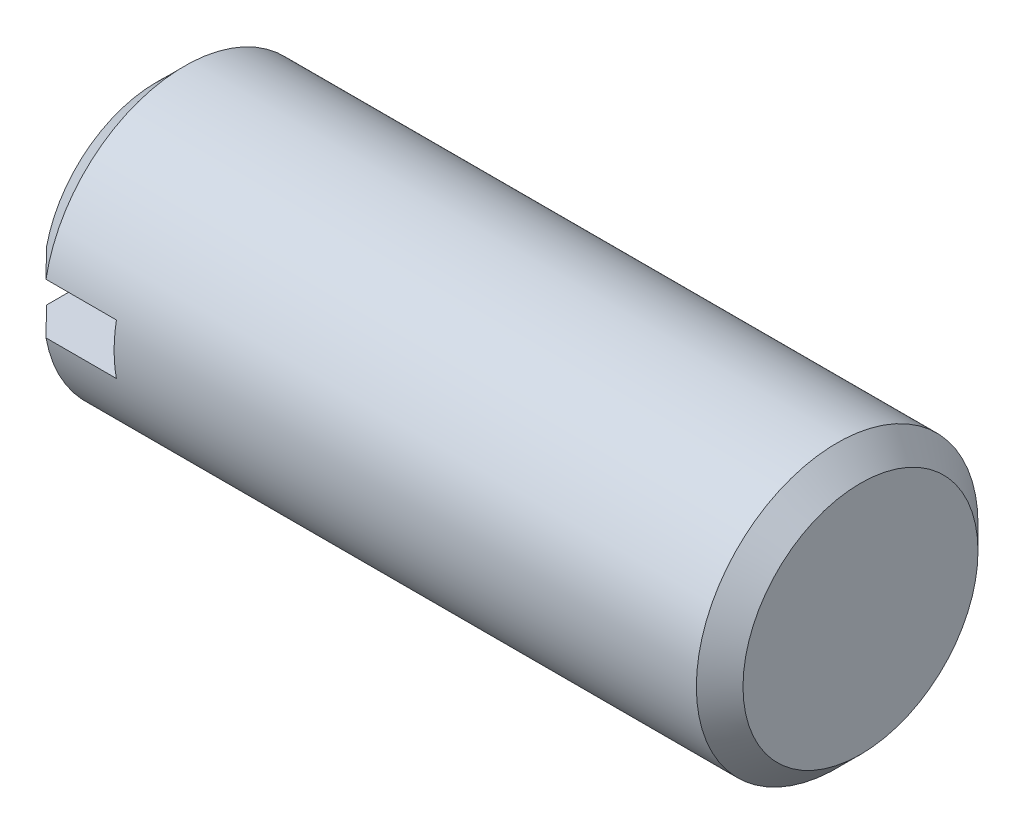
ISO-10303-21;
HEADER;
FILE_DESCRIPTION(('STEP AP214'),'2;1');
FILE_NAME('part.step','',(''),(''),'','','');
FILE_SCHEMA(('AUTOMOTIVE_DESIGN { 1 0 10303 214 1 1 1 1 }'));
ENDSEC;
DATA;
#1=APPLICATION_CONTEXT('core data for automotive mechanical design processes');
#2=APPLICATION_PROTOCOL_DEFINITION('international standard','automotive_design',2000,#1);
#3=PRODUCT_CONTEXT('',#1,'mechanical');
#4=PRODUCT('Part','Part','',(#3));
#5=PRODUCT_RELATED_PRODUCT_CATEGORY('part','',(#4));
#6=PRODUCT_DEFINITION_FORMATION('','',#4);
#7=PRODUCT_DEFINITION_CONTEXT('part definition',#1,'design');
#8=PRODUCT_DEFINITION('design','',#6,#7);
#9=PRODUCT_DEFINITION_SHAPE('','',#8);
#10=(LENGTH_UNIT() NAMED_UNIT(*) SI_UNIT(.MILLI.,.METRE.));
#11=(NAMED_UNIT(*) PLANE_ANGLE_UNIT() SI_UNIT($,.RADIAN.));
#12=(NAMED_UNIT(*) SI_UNIT($,.STERADIAN.) SOLID_ANGLE_UNIT());
#13=UNCERTAINTY_MEASURE_WITH_UNIT(LENGTH_MEASURE(1.E-05),#10,'distance_accuracy_value','');
#14=(GEOMETRIC_REPRESENTATION_CONTEXT(3) GLOBAL_UNCERTAINTY_ASSIGNED_CONTEXT((#13)) GLOBAL_UNIT_ASSIGNED_CONTEXT((#10,
#11,#12)) REPRESENTATION_CONTEXT('',''));
#15=CARTESIAN_POINT('',(0.,0.,0.));
#16=DIRECTION('',(0.,0.,1.));
#17=DIRECTION('',(1.,0.,0.));
#18=AXIS2_PLACEMENT_3D('',#15,#16,#17);
#19=CARTESIAN_POINT('',(0.,0.,0.));
#20=DIRECTION('',(-1.,0.,0.));
#21=DIRECTION('',(0.,0.,1.));
#22=AXIS2_PLACEMENT_3D('',#19,#20,#21);
#23=PLANE('',#22);
#24=DIRECTION('',(0.,0.,1.));
#25=VECTOR('',#24,1.);
#26=CARTESIAN_POINT('',(0.,0.9,-5.));
#27=LINE('',#26,#25);
#28=CARTESIAN_POINT('',(0.,0.9,-3.89743505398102));
#29=VERTEX_POINT('',#28);
#30=CARTESIAN_POINT('',(0.,0.9,3.89743505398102));
#31=VERTEX_POINT('',#30);
#32=EDGE_CURVE('E114',#29,#31,#27,.T.);
#33=ORIENTED_EDGE('',*,*,#32,.T.);
#34=CARTESIAN_POINT('',(0.,0.,0.));
#35=DIRECTION('',(-1.,0.,0.));
#36=DIRECTION('',(0.,0.,1.));
#37=AXIS2_PLACEMENT_3D('',#34,#35,#36);
#38=CIRCLE('',#37,4.);
#39=EDGE_CURVE('E102',#31,#29,#38,.T.);
#40=ORIENTED_EDGE('',*,*,#39,.T.);
#41=EDGE_LOOP('',(#33,#40));
#42=FACE_BOUND('',#41,.T.);
#43=ADVANCED_FACE('F39',(#42),#23,.T.);
#44=CARTESIAN_POINT('',(0.,0.,0.));
#45=DIRECTION('',(1.,0.,0.));
#46=DIRECTION('',(0.,0.,-1.));
#47=AXIS2_PLACEMENT_3D('',#44,#45,#46);
#48=CONICAL_SURFACE('',#47,4.,0.785398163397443);
#49=CARTESIAN_POINT('',(7.03012537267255,0.9,10.9933464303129));
#50=CARTESIAN_POINT('',(6.63966757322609,0.9,10.6015706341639));
#51=CARTESIAN_POINT('',(6.24926843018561,0.9,10.2097363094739));
#52=CARTESIAN_POINT('',(5.46864929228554,0.9,9.4258507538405));
#53=CARTESIAN_POINT('',(5.07842930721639,0.9,9.03379951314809));
#54=CARTESIAN_POINT('',(4.29780491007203,0.9,8.2489524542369));
#55=CARTESIAN_POINT('',(3.90740083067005,0.9,7.85615630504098));
#56=CARTESIAN_POINT('',(3.12704713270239,0.9,7.07015018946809));
#57=CARTESIAN_POINT('',(2.73709749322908,0.9,6.67694024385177));
#58=CARTESIAN_POINT('',(1.9790862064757,0.9,5.91120220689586));
#59=CARTESIAN_POINT('',(1.61098679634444,0.9,5.5387115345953));
#60=CARTESIAN_POINT('',(1.05967971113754,0.9,4.9790923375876));
#61=CARTESIAN_POINT('',(0.876037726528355,0.9,4.79239182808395));
#62=CARTESIAN_POINT('',(0.509170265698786,0.9,4.41858689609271));
#63=CARTESIAN_POINT('',(0.325944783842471,0.9,4.23148247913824));
#64=CARTESIAN_POINT('',(-0.0397740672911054,0.9,3.85681926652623));
#65=CARTESIAN_POINT('',(-0.222267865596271,0.9,3.66926089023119));
#66=CARTESIAN_POINT('',(-0.586330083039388,0.9,3.29322885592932));
#67=CARTESIAN_POINT('',(-0.767898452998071,0.9,3.10475515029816));
#68=CARTESIAN_POINT('',(-1.12946116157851,0.9,2.72638707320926));
#69=CARTESIAN_POINT('',(-1.30945588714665,0.9,2.5364930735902));
#70=CARTESIAN_POINT('',(-1.57726099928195,0.9,2.24962317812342));
#71=CARTESIAN_POINT('',(-1.66616118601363,0.9,2.1536658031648));
#72=CARTESIAN_POINT('',(-1.84289220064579,0.9,1.96077237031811));
#73=CARTESIAN_POINT('',(-1.93072306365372,0.9,1.86383634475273));
#74=CARTESIAN_POINT('',(-2.04199789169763,0.9,1.73894271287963));
#75=CARTESIAN_POINT('',(-2.06619519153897,0.9,1.71165610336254));
#76=CARTESIAN_POINT('',(-2.11444279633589,0.9,1.65695283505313));
#77=CARTESIAN_POINT('',(-2.13849309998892,0.9,1.62953617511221));
#78=CARTESIAN_POINT('',(-2.21039843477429,0.9,1.54706208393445));
#79=CARTESIAN_POINT('',(-2.2580032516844,0.9,1.49178573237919));
#80=CARTESIAN_POINT('',(-2.35275663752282,0.9,1.37996436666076));
#81=CARTESIAN_POINT('',(-2.39989697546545,0.9,1.32341235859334));
#82=CARTESIAN_POINT('',(-2.49291381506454,0.9,1.20929859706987));
#83=CARTESIAN_POINT('',(-2.5387906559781,0.9,1.15173712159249));
#84=CARTESIAN_POINT('',(-2.62920268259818,0.9,1.03464389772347));
#85=CARTESIAN_POINT('',(-2.6737199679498,0.9,0.975098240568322));
#86=CARTESIAN_POINT('',(-2.76007627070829,0.9,0.85394570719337));
#87=CARTESIAN_POINT('',(-2.80191166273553,0.9,0.792336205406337));
#88=CARTESIAN_POINT('',(-2.88088250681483,0.9,0.666924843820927));
#89=CARTESIAN_POINT('',(-2.91805737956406,0.9,0.603148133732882));
#90=CARTESIAN_POINT('',(-2.98530096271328,0.9,0.471982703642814));
#91=CARTESIAN_POINT('',(-3.01539165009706,0.9,0.404605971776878));
#92=CARTESIAN_POINT('',(-3.0488887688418,0.9,0.308587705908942));
#93=CARTESIAN_POINT('',(-3.05730277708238,0.9,0.281702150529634));
#94=CARTESIAN_POINT('',(-3.07209259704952,0.9,0.227377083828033));
#95=CARTESIAN_POINT('',(-3.07846834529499,0.9,0.199937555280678));
#96=CARTESIAN_POINT('',(-3.09401174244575,0.9,0.1171209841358));
#97=CARTESIAN_POINT('',(-3.09968136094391,0.9,0.0610145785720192));
#98=CARTESIAN_POINT('',(-3.10029333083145,0.9,-0.0514662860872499));
#99=CARTESIAN_POINT('',(-3.09519258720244,0.9,-0.107840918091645));
#100=CARTESIAN_POINT('',(-3.07538257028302,0.9,-0.218954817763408));
#101=CARTESIAN_POINT('',(-3.06064195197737,0.9,-0.27368813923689));
#102=CARTESIAN_POINT('',(-3.02277680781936,0.9,-0.384566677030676));
#103=CARTESIAN_POINT('',(-2.99911604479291,0.9,-0.440520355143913));
#104=CARTESIAN_POINT('',(-2.94640601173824,0.9,-0.549873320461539));
#105=CARTESIAN_POINT('',(-2.91734636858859,0.9,-0.603267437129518));
#106=CARTESIAN_POINT('',(-2.85545285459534,0.9,-0.708381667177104));
#107=CARTESIAN_POINT('',(-2.82258962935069,0.9,-0.76008418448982));
#108=CARTESIAN_POINT('',(-2.75448893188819,0.9,-0.861812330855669));
#109=CARTESIAN_POINT('',(-2.71925366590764,0.9,-0.91183945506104));
#110=CARTESIAN_POINT('',(-2.64368992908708,0.9,-1.01535458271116));
#111=CARTESIAN_POINT('',(-2.60319542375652,0.9,-1.06872054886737));
#112=CARTESIAN_POINT('',(-2.52079950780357,0.9,-1.17435884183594));
#113=CARTESIAN_POINT('',(-2.47889791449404,0.9,-1.2266310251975));
#114=CARTESIAN_POINT('',(-2.35165357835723,0.9,-1.38226463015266));
#115=CARTESIAN_POINT('',(-2.26480844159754,0.9,-1.48439389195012));
#116=CARTESIAN_POINT('',(-2.08871660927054,0.9,-1.68684867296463));
#117=CARTESIAN_POINT('',(-1.99946598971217,0.9,-1.78717073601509));
#118=CARTESIAN_POINT('',(-1.81955939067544,0.9,-1.98649442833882));
#119=CARTESIAN_POINT('',(-1.72890380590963,0.9,-2.08549641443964));
#120=CARTESIAN_POINT('',(-1.54699288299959,0.9,-2.28224352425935));
#121=CARTESIAN_POINT('',(-1.4557411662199,0.9,-2.37999200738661));
#122=CARTESIAN_POINT('',(-1.27257057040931,0.9,-2.57487399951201));
#123=CARTESIAN_POINT('',(-1.18065164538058,0.9,-2.67200746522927));
#124=CARTESIAN_POINT('',(-0.99642863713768,0.9,-2.86571716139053));
#125=CARTESIAN_POINT('',(-0.904125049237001,0.9,-2.96229386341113));
#126=CARTESIAN_POINT('',(-0.71915969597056,0.9,-3.15509916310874));
#127=CARTESIAN_POINT('',(-0.626497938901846,0.9,-3.25132776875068));
#128=CARTESIAN_POINT('',(-0.378023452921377,0.9,-3.50862901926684));
#129=CARTESIAN_POINT('',(-0.221961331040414,0.9,-3.66946075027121));
#130=CARTESIAN_POINT('',(0.0906838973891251,0.9,-3.99061724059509));
#131=CARTESIAN_POINT('',(0.247267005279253,0.9,-4.15094199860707));
#132=CARTESIAN_POINT('',(0.717564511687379,0.9,-4.63138888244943));
#133=CARTESIAN_POINT('',(1.03182241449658,0.9,-4.95097879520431));
#134=CARTESIAN_POINT('',(1.66127792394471,0.9,-5.58953327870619));
#135=CARTESIAN_POINT('',(1.97647590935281,0.9,-5.9084974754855));
#136=CARTESIAN_POINT('',(2.60736097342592,0.9,-6.54593750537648));
#137=CARTESIAN_POINT('',(2.92304804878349,0.9,-6.86441334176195));
#138=CARTESIAN_POINT('',(3.55448673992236,0.9,-7.50078813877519));
#139=CARTESIAN_POINT('',(3.87023809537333,0.9,-7.81868735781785));
#140=CARTESIAN_POINT('',(4.50196382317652,0.9,-8.45426552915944));
#141=CARTESIAN_POINT('',(4.81793819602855,0.9,-8.77194448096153));
#142=CARTESIAN_POINT('',(5.44988114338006,0.9,-9.40697802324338));
#143=CARTESIAN_POINT('',(5.76584963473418,0.9,-9.72433269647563));
#144=CARTESIAN_POINT('',(6.39790674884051,0.9,-10.3589208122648));
#145=CARTESIAN_POINT('',(6.71399537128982,0.9,-10.6761542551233));
#146=CARTESIAN_POINT('',(7.03012537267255,0.9,-10.9933464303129));
#147=B_SPLINE_CURVE_WITH_KNOTS('',3,(#49,#50,#51,#52,#53,#54,#55,#56,#57,#58,#59,#60,#61,#62,
#63,#64,#65,#66,#67,#68,#69,#70,#71,#72,#73,#74,#75,#76,#77,#78,#79,#80,#81,#82,#83,#84,#85,#86,
#87,#88,#89,#90,#91,#92,#93,#94,#95,#96,#97,#98,#99,#100,#101,#102,#103,#104,#105,#106,#107,
#108,#109,#110,#111,#112,#113,#114,#115,#116,#117,#118,#119,#120,#121,#122,#123,#124,#125,#126,
#127,#128,#129,#130,#131,#132,#133,#134,#135,#136,#137,#138,#139,#140,#141,#142,#143,#144,#145,
#146),.UNSPECIFIED.,.F.,.F.,(4,2,2,2,2,2,2,2,2,2,2,2,2,2,2,2,2,2,2,2,2,2,2,2,2,2,2,2,2,2,2,2,2,
2,2,2,2,2,2,2,2,2,2,2,2,2,2,2,4),(0.,1.65937046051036,3.31882280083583,4.98024888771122,
6.64159525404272,8.21264999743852,8.99829138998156,9.78392208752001,10.5689923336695,
11.3541038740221,12.139016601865,12.5314400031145,12.9238504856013,13.0332603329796,
13.1426711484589,13.3615136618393,13.5823702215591,13.8031668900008,14.0261613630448,
14.2494511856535,14.4707025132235,14.6912581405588,14.775701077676,14.8601466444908,
15.0283060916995,15.1971396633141,15.3665249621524,15.5483506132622,15.7305292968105,
15.9142217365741,16.097745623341,16.2986837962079,16.4996481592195,16.9017617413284,
17.304576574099,17.7072802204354,18.108443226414,18.5096341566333,18.9104111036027,
19.3111788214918,19.9834863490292,20.6557956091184,22.0004342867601,23.345718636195,
24.6909939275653,26.035177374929,27.3793638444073,28.722848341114,30.0663294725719),.UNSPECIFIED.);
#148=CARTESIAN_POINT('',(1.00000000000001,0.9,4.91833305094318));
#149=VERTEX_POINT('',#148);
#150=EDGE_CURVE('E126',#149,#31,#147,.T.);
#151=ORIENTED_EDGE('',*,*,#150,.F.);
#152=CARTESIAN_POINT('',(1.00000000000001,0.,0.));
#153=DIRECTION('',(-1.,0.,0.));
#154=DIRECTION('',(0.,0.,1.));
#155=AXIS2_PLACEMENT_3D('',#152,#153,#154);
#156=CIRCLE('',#155,5.);
#157=CARTESIAN_POINT('',(1.00000000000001,0.9,-4.91833305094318));
#158=VERTEX_POINT('',#157);
#159=EDGE_CURVE('E171',#149,#158,#156,.T.);
#160=ORIENTED_EDGE('',*,*,#159,.T.);
#161=EDGE_CURVE('E62',#29,#158,#147,.T.);
#162=ORIENTED_EDGE('',*,*,#161,.F.);
#163=ORIENTED_EDGE('',*,*,#39,.F.);
#164=EDGE_LOOP('',(#151,#160,#162,#163));
#165=FACE_BOUND('',#164,.T.);
#166=ADVANCED_FACE('F154',(#165),#48,.T.);
#167=DIRECTION('',(0.,0.,1.));
#168=VECTOR('',#167,1.);
#169=CARTESIAN_POINT('',(0.,-0.9,-5.));
#170=LINE('',#169,#168);
#171=CARTESIAN_POINT('',(0.,-0.9,-3.89743505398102));
#172=VERTEX_POINT('',#171);
#173=CARTESIAN_POINT('',(0.,-0.9,3.89743505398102));
#174=VERTEX_POINT('',#173);
#175=EDGE_CURVE('E112',#172,#174,#170,.T.);
#176=ORIENTED_EDGE('',*,*,#175,.F.);
#177=EDGE_CURVE('E169',#172,#174,#38,.T.);
#178=ORIENTED_EDGE('',*,*,#177,.T.);
#179=EDGE_LOOP('',(#176,#178));
#180=FACE_BOUND('',#179,.T.);
#181=ADVANCED_FACE('F41',(#180),#23,.T.);
#182=CARTESIAN_POINT('',(7.03012537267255,-0.9,-10.9933464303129));
#183=CARTESIAN_POINT('',(6.63966757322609,-0.9,-10.6015706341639));
#184=CARTESIAN_POINT('',(6.2492684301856,-0.9,-10.2097363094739));
#185=CARTESIAN_POINT('',(5.46864929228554,-0.9,-9.4258507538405));
#186=CARTESIAN_POINT('',(5.07842930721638,-0.9,-9.03379951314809));
#187=CARTESIAN_POINT('',(4.29780491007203,-0.9,-8.2489524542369));
#188=CARTESIAN_POINT('',(3.90740083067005,-0.9,-7.85615630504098));
#189=CARTESIAN_POINT('',(3.12704713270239,-0.9,-7.07015018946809));
#190=CARTESIAN_POINT('',(2.73709749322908,-0.9,-6.67694024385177));
#191=CARTESIAN_POINT('',(1.9790862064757,-0.9,-5.91120220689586));
#192=CARTESIAN_POINT('',(1.61098679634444,-0.9,-5.5387115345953));
#193=CARTESIAN_POINT('',(1.05967971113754,-0.9,-4.9790923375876));
#194=CARTESIAN_POINT('',(0.876037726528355,-0.9,-4.79239182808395));
#195=CARTESIAN_POINT('',(0.509170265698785,-0.9,-4.41858689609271));
#196=CARTESIAN_POINT('',(0.325944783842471,-0.9,-4.23148247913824));
#197=CARTESIAN_POINT('',(-0.039774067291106,-0.9,-3.85681926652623));
#198=CARTESIAN_POINT('',(-0.222267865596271,-0.9,-3.66926089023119));
#199=CARTESIAN_POINT('',(-0.586330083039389,-0.9,-3.29322885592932));
#200=CARTESIAN_POINT('',(-0.767898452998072,-0.9,-3.10475515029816));
#201=CARTESIAN_POINT('',(-1.12946116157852,-0.9,-2.72638707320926));
#202=CARTESIAN_POINT('',(-1.30945588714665,-0.9,-2.5364930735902));
#203=CARTESIAN_POINT('',(-1.57726099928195,-0.9,-2.24962317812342));
#204=CARTESIAN_POINT('',(-1.66616118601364,-0.9,-2.1536658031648));
#205=CARTESIAN_POINT('',(-1.8428922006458,-0.9,-1.9607723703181));
#206=CARTESIAN_POINT('',(-1.93072306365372,-0.9,-1.86383634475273));
#207=CARTESIAN_POINT('',(-2.04199789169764,-0.9,-1.73894271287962));
#208=CARTESIAN_POINT('',(-2.06619519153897,-0.9,-1.71165610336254));
#209=CARTESIAN_POINT('',(-2.11444279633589,-0.9,-1.65695283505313));
#210=CARTESIAN_POINT('',(-2.13849309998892,-0.9,-1.62953617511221));
#211=CARTESIAN_POINT('',(-2.21039843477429,-0.9,-1.54706208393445));
#212=CARTESIAN_POINT('',(-2.25800325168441,-0.9,-1.49178573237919));
#213=CARTESIAN_POINT('',(-2.35275663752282,-0.9,-1.37996436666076));
#214=CARTESIAN_POINT('',(-2.39989697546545,-0.9,-1.32341235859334));
#215=CARTESIAN_POINT('',(-2.49291381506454,-0.9,-1.20929859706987));
#216=CARTESIAN_POINT('',(-2.5387906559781,-0.9,-1.15173712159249));
#217=CARTESIAN_POINT('',(-2.62920268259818,-0.9,-1.03464389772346));
#218=CARTESIAN_POINT('',(-2.6737199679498,-0.9,-0.97509824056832));
#219=CARTESIAN_POINT('',(-2.76007627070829,-0.9,-0.853945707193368));
#220=CARTESIAN_POINT('',(-2.80191166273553,-0.9,-0.792336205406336));
#221=CARTESIAN_POINT('',(-2.88088250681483,-0.9,-0.666924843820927));
#222=CARTESIAN_POINT('',(-2.91805737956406,-0.9,-0.603148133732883));
#223=CARTESIAN_POINT('',(-2.98530096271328,-0.9,-0.471982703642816));
#224=CARTESIAN_POINT('',(-3.01539165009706,-0.9,-0.404605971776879));
#225=CARTESIAN_POINT('',(-3.0488887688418,-0.9,-0.308587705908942));
#226=CARTESIAN_POINT('',(-3.05730277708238,-0.9,-0.281702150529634));
#227=CARTESIAN_POINT('',(-3.07209259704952,-0.9,-0.227377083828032));
#228=CARTESIAN_POINT('',(-3.07846834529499,-0.9,-0.199937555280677));
#229=CARTESIAN_POINT('',(-3.09401174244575,-0.9,-0.117120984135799));
#230=CARTESIAN_POINT('',(-3.09968136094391,-0.9,-0.0610145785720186));
#231=CARTESIAN_POINT('',(-3.10029333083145,-0.9,0.05146628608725));
#232=CARTESIAN_POINT('',(-3.09519258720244,-0.9,0.107840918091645));
#233=CARTESIAN_POINT('',(-3.07538257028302,-0.9,0.218954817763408));
#234=CARTESIAN_POINT('',(-3.06064195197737,-0.9,0.273688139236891));
#235=CARTESIAN_POINT('',(-3.02277680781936,-0.9,0.384566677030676));
#236=CARTESIAN_POINT('',(-2.99911604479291,-0.9,0.440520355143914));
#237=CARTESIAN_POINT('',(-2.94640601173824,-0.9,0.549873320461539));
#238=CARTESIAN_POINT('',(-2.91734636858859,-0.9,0.60326743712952));
#239=CARTESIAN_POINT('',(-2.85545285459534,-0.9,0.708381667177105));
#240=CARTESIAN_POINT('',(-2.82258962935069,-0.9,0.760084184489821));
#241=CARTESIAN_POINT('',(-2.75448893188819,-0.9,0.861812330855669));
#242=CARTESIAN_POINT('',(-2.71925366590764,-0.9,0.911839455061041));
#243=CARTESIAN_POINT('',(-2.64368992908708,-0.9,1.01535458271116));
#244=CARTESIAN_POINT('',(-2.60319542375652,-0.9,1.06872054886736));
#245=CARTESIAN_POINT('',(-2.52079950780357,-0.9,1.17435884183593));
#246=CARTESIAN_POINT('',(-2.47889791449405,-0.9,1.2266310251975));
#247=CARTESIAN_POINT('',(-2.35165357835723,-0.9,1.38226463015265));
#248=CARTESIAN_POINT('',(-2.26480844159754,-0.9,1.48439389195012));
#249=CARTESIAN_POINT('',(-2.08871660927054,-0.9,1.68684867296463));
#250=CARTESIAN_POINT('',(-1.99946598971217,-0.9,1.78717073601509));
#251=CARTESIAN_POINT('',(-1.81955939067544,-0.9,1.98649442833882));
#252=CARTESIAN_POINT('',(-1.72890380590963,-0.9,2.08549641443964));
#253=CARTESIAN_POINT('',(-1.54699288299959,-0.9,2.28224352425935));
#254=CARTESIAN_POINT('',(-1.4557411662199,-0.9,2.37999200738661));
#255=CARTESIAN_POINT('',(-1.27257057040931,-0.9,2.57487399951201));
#256=CARTESIAN_POINT('',(-1.18065164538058,-0.9,2.67200746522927));
#257=CARTESIAN_POINT('',(-0.996428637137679,-0.9,2.86571716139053));
#258=CARTESIAN_POINT('',(-0.904125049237,-0.9,2.96229386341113));
#259=CARTESIAN_POINT('',(-0.719159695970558,-0.9,3.15509916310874));
#260=CARTESIAN_POINT('',(-0.626497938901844,-0.9,3.25132776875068));
#261=CARTESIAN_POINT('',(-0.378023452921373,-0.9,3.50862901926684));
#262=CARTESIAN_POINT('',(-0.221961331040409,-0.9,3.66946075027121));
#263=CARTESIAN_POINT('',(0.0906838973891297,-0.9,3.9906172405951));
#264=CARTESIAN_POINT('',(0.247267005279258,-0.9,4.15094199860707));
#265=CARTESIAN_POINT('',(0.717564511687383,-0.9,4.63138888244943));
#266=CARTESIAN_POINT('',(1.03182241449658,-0.9,4.95097879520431));
#267=CARTESIAN_POINT('',(1.66127792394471,-0.9,5.58953327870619));
#268=CARTESIAN_POINT('',(1.97647590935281,-0.9,5.9084974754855));
#269=CARTESIAN_POINT('',(2.60736097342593,-0.9,6.54593750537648));
#270=CARTESIAN_POINT('',(2.92304804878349,-0.9,6.86441334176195));
#271=CARTESIAN_POINT('',(3.55448673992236,-0.9,7.50078813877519));
#272=CARTESIAN_POINT('',(3.87023809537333,-0.9,7.81868735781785));
#273=CARTESIAN_POINT('',(4.50196382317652,-0.9,8.45426552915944));
#274=CARTESIAN_POINT('',(4.81793819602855,-0.9,8.77194448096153));
#275=CARTESIAN_POINT('',(5.44988114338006,-0.9,9.40697802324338));
#276=CARTESIAN_POINT('',(5.76584963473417,-0.9,9.72433269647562));
#277=CARTESIAN_POINT('',(6.3979067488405,-0.9,10.3589208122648));
#278=CARTESIAN_POINT('',(6.71399537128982,-0.9,10.6761542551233));
#279=CARTESIAN_POINT('',(7.03012537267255,-0.9,10.9933464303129));
#280=B_SPLINE_CURVE_WITH_KNOTS('',3,(#182,#183,#184,#185,#186,#187,#188,#189,#190,#191,#192,
#193,#194,#195,#196,#197,#198,#199,#200,#201,#202,#203,#204,#205,#206,#207,#208,#209,#210,#211,
#212,#213,#214,#215,#216,#217,#218,#219,#220,#221,#222,#223,#224,#225,#226,#227,#228,#229,#230,
#231,#232,#233,#234,#235,#236,#237,#238,#239,#240,#241,#242,#243,#244,#245,#246,#247,#248,#249,
#250,#251,#252,#253,#254,#255,#256,#257,#258,#259,#260,#261,#262,#263,#264,#265,#266,#267,#268,
#269,#270,#271,#272,#273,#274,#275,#276,#277,#278,#279),.UNSPECIFIED.,.F.,.F.,(4,2,2,2,2,2,2,2,
2,2,2,2,2,2,2,2,2,2,2,2,2,2,2,2,2,2,2,2,2,2,2,2,2,2,2,2,2,2,2,2,2,2,2,2,2,2,2,2,4),(0.,
1.65937046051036,3.31882280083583,4.98024888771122,6.64159525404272,8.21264999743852,
8.99829138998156,9.78392208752,10.5689923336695,11.3541038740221,12.139016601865,
12.5314400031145,12.9238504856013,13.0332603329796,13.1426711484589,13.3615136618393,
13.5823702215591,13.8031668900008,14.0261613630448,14.2494511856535,14.4707025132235,
14.6912581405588,14.775701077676,14.8601466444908,15.0283060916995,15.1971396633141,
15.3665249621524,15.5483506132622,15.7305292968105,15.9142217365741,16.097745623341,
16.2986837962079,16.4996481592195,16.9017617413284,17.304576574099,17.7072802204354,
18.108443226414,18.5096341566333,18.9104111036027,19.3111788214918,19.9834863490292,
20.6557956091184,22.0004342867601,23.345718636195,24.6909939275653,26.035177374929,
27.3793638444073,28.722848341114,30.0663294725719),.UNSPECIFIED.);
#281=CARTESIAN_POINT('',(1.00000000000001,-0.9,-4.91833305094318));
#282=VERTEX_POINT('',#281);
#283=EDGE_CURVE('E119',#282,#172,#280,.T.);
#284=ORIENTED_EDGE('',*,*,#283,.F.);
#285=CARTESIAN_POINT('',(1.00000000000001,-0.9,4.91833305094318));
#286=VERTEX_POINT('',#285);
#287=EDGE_CURVE('E175',#282,#286,#156,.T.);
#288=ORIENTED_EDGE('',*,*,#287,.T.);
#289=EDGE_CURVE('E109',#174,#286,#280,.T.);
#290=ORIENTED_EDGE('',*,*,#289,.F.);
#291=ORIENTED_EDGE('',*,*,#177,.F.);
#292=EDGE_LOOP('',(#284,#288,#290,#291));
#293=FACE_BOUND('',#292,.T.);
#294=ADVANCED_FACE('F133',(#293),#48,.T.);
#295=CARTESIAN_POINT('',(-3.67611336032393,0.,0.));
#296=DIRECTION('',(-1.,0.,0.));
#297=DIRECTION('',(0.,0.,1.));
#298=AXIS2_PLACEMENT_3D('',#295,#296,#297);
#299=CYLINDRICAL_SURFACE('',#298,5.);
#300=CARTESIAN_POINT('',(3.5,0.,0.));
#301=DIRECTION('',(1.,0.,0.));
#302=DIRECTION('',(0.,0.,-1.));
#303=AXIS2_PLACEMENT_3D('',#300,#301,#302);
#304=CIRCLE('',#303,5.);
#305=CARTESIAN_POINT('',(3.5,-0.9,4.91833305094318));
#306=VERTEX_POINT('',#305);
#307=CARTESIAN_POINT('',(3.5,0.9,4.91833305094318));
#308=VERTEX_POINT('',#307);
#309=EDGE_CURVE('E94',#306,#308,#304,.F.);
#310=ORIENTED_EDGE('',*,*,#309,.F.);
#311=DIRECTION('',(-1.,0.,0.));
#312=VECTOR('',#311,1.);
#313=CARTESIAN_POINT('',(-3.67611336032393,-0.9,4.91833305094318));
#314=LINE('',#313,#312);
#315=EDGE_CURVE('E11',#286,#306,#314,.F.);
#316=ORIENTED_EDGE('',*,*,#315,.F.);
#317=ORIENTED_EDGE('',*,*,#287,.F.);
#318=DIRECTION('',(-1.,0.,0.));
#319=VECTOR('',#318,1.);
#320=CARTESIAN_POINT('',(-3.67611336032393,-0.9,-4.91833305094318));
#321=LINE('',#320,#319);
#322=CARTESIAN_POINT('',(3.5,-0.9,-4.91833305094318));
#323=VERTEX_POINT('',#322);
#324=EDGE_CURVE('E47',#323,#282,#321,.T.);
#325=ORIENTED_EDGE('',*,*,#324,.F.);
#326=CARTESIAN_POINT('',(3.5,0.9,-4.91833305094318));
#327=VERTEX_POINT('',#326);
#328=EDGE_CURVE('E54',#327,#323,#304,.F.);
#329=ORIENTED_EDGE('',*,*,#328,.F.);
#330=DIRECTION('',(-1.,0.,0.));
#331=VECTOR('',#330,1.);
#332=CARTESIAN_POINT('',(-3.67611336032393,0.9,-4.91833305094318));
#333=LINE('',#332,#331);
#334=EDGE_CURVE('E180',#158,#327,#333,.F.);
#335=ORIENTED_EDGE('',*,*,#334,.F.);
#336=ORIENTED_EDGE('',*,*,#159,.F.);
#337=DIRECTION('',(-1.,0.,0.));
#338=VECTOR('',#337,1.);
#339=CARTESIAN_POINT('',(-3.67611336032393,0.9,4.91833305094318));
#340=LINE('',#339,#338);
#341=EDGE_CURVE('E100',#308,#149,#340,.T.);
#342=ORIENTED_EDGE('',*,*,#341,.F.);
#343=EDGE_LOOP('',(#310,#316,#317,#325,#329,#335,#336,#342));
#344=FACE_BOUND('',#343,.T.);
#345=CARTESIAN_POINT('',(24.1719999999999,0.,0.));
#346=DIRECTION('',(-1.,0.,0.));
#347=DIRECTION('',(0.,0.,1.));
#348=AXIS2_PLACEMENT_3D('',#345,#346,#347);
#349=CIRCLE('',#348,5.);
#350=CARTESIAN_POINT('',(24.1719999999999,0.,5.));
#351=VERTEX_POINT('',#350);
#352=EDGE_CURVE('E181',#351,#351,#349,.T.);
#353=ORIENTED_EDGE('',*,*,#352,.T.);
#354=EDGE_LOOP('',(#353));
#355=FACE_BOUND('',#354,.T.);
#356=ADVANCED_FACE('F95',(#344,#355),#299,.T.);
#357=CARTESIAN_POINT('',(25.,0.,0.));
#358=DIRECTION('',(-1.,0.,0.));
#359=DIRECTION('',(0.,0.,1.));
#360=AXIS2_PLACEMENT_3D('',#357,#358,#359);
#361=CONICAL_SURFACE('',#360,4.17200000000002,0.785398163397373);
#362=ORIENTED_EDGE('',*,*,#352,.F.);
#363=EDGE_LOOP('',(#362));
#364=FACE_BOUND('',#363,.T.);
#365=CARTESIAN_POINT('',(25.,0.,0.));
#366=DIRECTION('',(-1.,0.,0.));
#367=DIRECTION('',(0.,0.,1.));
#368=AXIS2_PLACEMENT_3D('',#365,#366,#367);
#369=CIRCLE('',#368,4.17200000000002);
#370=CARTESIAN_POINT('',(25.,0.,4.17200000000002));
#371=VERTEX_POINT('',#370);
#372=EDGE_CURVE('E183',#371,#371,#369,.T.);
#373=ORIENTED_EDGE('',*,*,#372,.T.);
#374=EDGE_LOOP('',(#373));
#375=FACE_BOUND('',#374,.T.);
#376=ADVANCED_FACE('F144',(#364,#375),#361,.T.);
#377=CARTESIAN_POINT('',(25.,4.17200000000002,0.));
#378=DIRECTION('',(1.,0.,0.));
#379=DIRECTION('',(0.,0.,-1.));
#380=AXIS2_PLACEMENT_3D('',#377,#378,#379);
#381=PLANE('',#380);
#382=ORIENTED_EDGE('',*,*,#372,.F.);
#383=EDGE_LOOP('',(#382));
#384=FACE_BOUND('',#383,.T.);
#385=ADVANCED_FACE('F140',(#384),#381,.T.);
#386=CARTESIAN_POINT('',(0.,0.9,-5.));
#387=DIRECTION('',(0.,1.,0.));
#388=DIRECTION('',(-1.,0.,0.));
#389=AXIS2_PLACEMENT_3D('',#386,#387,#388);
#390=PLANE('',#389);
#391=ORIENTED_EDGE('',*,*,#161,.T.);
#392=ORIENTED_EDGE('',*,*,#334,.T.);
#393=DIRECTION('',(0.,0.,1.));
#394=VECTOR('',#393,1.);
#395=CARTESIAN_POINT('',(3.5,0.9,-5.));
#396=LINE('',#395,#394);
#397=EDGE_CURVE('E111',#327,#308,#396,.T.);
#398=ORIENTED_EDGE('',*,*,#397,.T.);
#399=ORIENTED_EDGE('',*,*,#341,.T.);
#400=ORIENTED_EDGE('',*,*,#150,.T.);
#401=ORIENTED_EDGE('',*,*,#32,.F.);
#402=EDGE_LOOP('',(#391,#392,#398,#399,#400,#401));
#403=FACE_BOUND('',#402,.T.);
#404=ADVANCED_FACE('F143',(#403),#390,.F.);
#405=CARTESIAN_POINT('',(3.5,0.9,-5.));
#406=DIRECTION('',(1.,0.,0.));
#407=DIRECTION('',(0.,0.,-1.));
#408=AXIS2_PLACEMENT_3D('',#405,#406,#407);
#409=PLANE('',#408);
#410=DIRECTION('',(0.,0.,1.));
#411=VECTOR('',#410,1.);
#412=CARTESIAN_POINT('',(3.5,-0.9,-5.));
#413=LINE('',#412,#411);
#414=EDGE_CURVE('E106',#323,#306,#413,.T.);
#415=ORIENTED_EDGE('',*,*,#414,.T.);
#416=ORIENTED_EDGE('',*,*,#309,.T.);
#417=ORIENTED_EDGE('',*,*,#397,.F.);
#418=ORIENTED_EDGE('',*,*,#328,.T.);
#419=EDGE_LOOP('',(#415,#416,#417,#418));
#420=FACE_BOUND('',#419,.T.);
#421=ADVANCED_FACE('F110',(#420),#409,.F.);
#422=CARTESIAN_POINT('',(0.,-0.9,-5.));
#423=DIRECTION('',(0.,-1.,0.));
#424=DIRECTION('',(0.,0.,-1.));
#425=AXIS2_PLACEMENT_3D('',#422,#423,#424);
#426=PLANE('',#425);
#427=ORIENTED_EDGE('',*,*,#289,.T.);
#428=ORIENTED_EDGE('',*,*,#315,.T.);
#429=ORIENTED_EDGE('',*,*,#414,.F.);
#430=ORIENTED_EDGE('',*,*,#324,.T.);
#431=ORIENTED_EDGE('',*,*,#283,.T.);
#432=ORIENTED_EDGE('',*,*,#175,.T.);
#433=EDGE_LOOP('',(#427,#428,#429,#430,#431,#432));
#434=FACE_BOUND('',#433,.T.);
#435=ADVANCED_FACE('F105',(#434),#426,.F.);
#436=CLOSED_SHELL('',(#43,#166,#181,#294,#356,#376,#385,#404,#421,#435));
#437=MANIFOLD_SOLID_BREP('B2',#436);
#438=ADVANCED_BREP_SHAPE_REPRESENTATION('',(#18,#437),#14);
#439=SHAPE_DEFINITION_REPRESENTATION(#9,#438);
ENDSEC;
END-ISO-10303-21;
